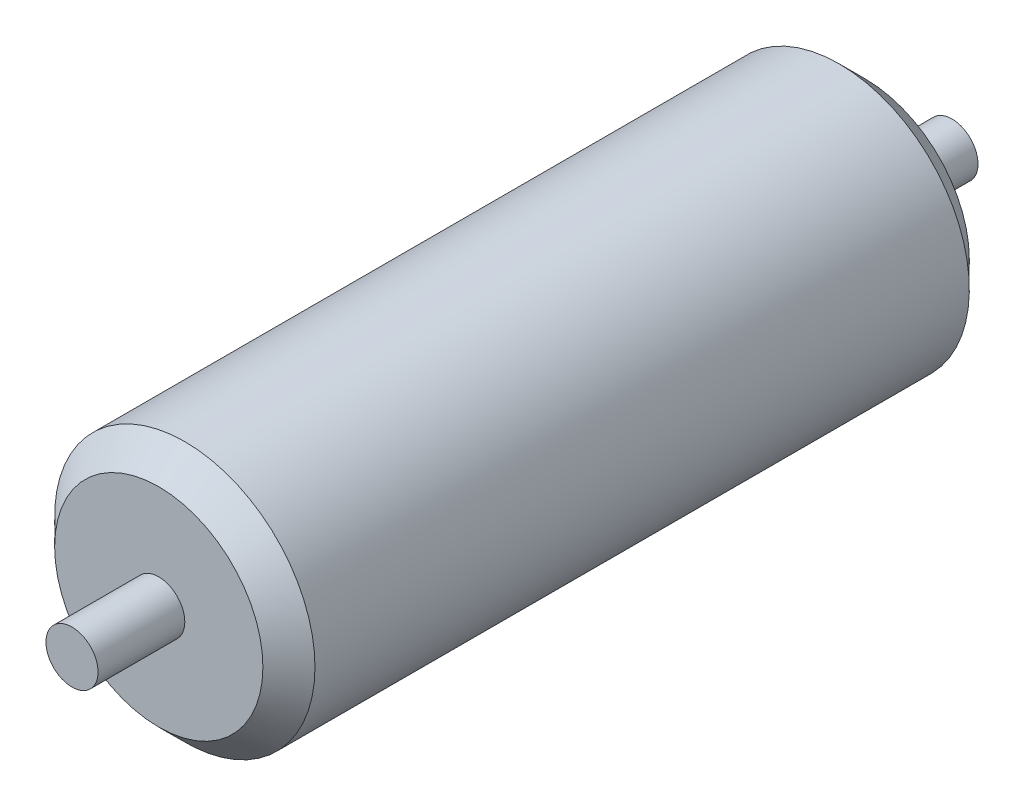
ISO-10303-21;
HEADER;
FILE_DESCRIPTION(('STEP AP214'),'2;1');
FILE_NAME('part.step','',(''),(''),'','','');
FILE_SCHEMA(('AUTOMOTIVE_DESIGN { 1 0 10303 214 1 1 1 1 }'));
ENDSEC;
DATA;
#1=APPLICATION_CONTEXT('core data for automotive mechanical design processes');
#2=APPLICATION_PROTOCOL_DEFINITION('international standard','automotive_design',2000,#1);
#3=PRODUCT_CONTEXT('',#1,'mechanical');
#4=PRODUCT('Part','Part','',(#3));
#5=PRODUCT_RELATED_PRODUCT_CATEGORY('part','',(#4));
#6=PRODUCT_DEFINITION_FORMATION('','',#4);
#7=PRODUCT_DEFINITION_CONTEXT('part definition',#1,'design');
#8=PRODUCT_DEFINITION('design','',#6,#7);
#9=PRODUCT_DEFINITION_SHAPE('','',#8);
#10=(LENGTH_UNIT() NAMED_UNIT(*) SI_UNIT(.MILLI.,.METRE.));
#11=(NAMED_UNIT(*) PLANE_ANGLE_UNIT() SI_UNIT($,.RADIAN.));
#12=(NAMED_UNIT(*) SI_UNIT($,.STERADIAN.) SOLID_ANGLE_UNIT());
#13=UNCERTAINTY_MEASURE_WITH_UNIT(LENGTH_MEASURE(1.E-05),#10,'distance_accuracy_value','');
#14=(GEOMETRIC_REPRESENTATION_CONTEXT(3) GLOBAL_UNCERTAINTY_ASSIGNED_CONTEXT((#13)) GLOBAL_UNIT_ASSIGNED_CONTEXT((#10,
#11,#12)) REPRESENTATION_CONTEXT('',''));
#15=CARTESIAN_POINT('',(0.,0.,0.));
#16=DIRECTION('',(0.,0.,1.));
#17=DIRECTION('',(1.,0.,0.));
#18=AXIS2_PLACEMENT_3D('',#15,#16,#17);
#19=CARTESIAN_POINT('',(0.,0.,407.));
#20=DIRECTION('',(0.,0.,1.));
#21=DIRECTION('',(0.,-1.,0.));
#22=AXIS2_PLACEMENT_3D('',#19,#20,#21);
#23=PLANE('',#22);
#24=CARTESIAN_POINT('',(0.,0.,407.));
#25=DIRECTION('',(0.,0.,-1.));
#26=DIRECTION('',(0.,1.,0.));
#27=AXIS2_PLACEMENT_3D('',#24,#25,#26);
#28=CIRCLE('',#27,120.);
#29=CARTESIAN_POINT('',(0.,120.,407.));
#30=VERTEX_POINT('',#29);
#31=EDGE_CURVE('E48',#30,#30,#28,.T.);
#32=ORIENTED_EDGE('',*,*,#31,.F.);
#33=EDGE_LOOP('',(#32));
#34=FACE_BOUND('',#33,.T.);
#35=CARTESIAN_POINT('',(0.,0.,407.));
#36=DIRECTION('',(0.,0.,1.));
#37=DIRECTION('',(1.,0.,0.));
#38=AXIS2_PLACEMENT_3D('',#35,#36,#37);
#39=CIRCLE('',#38,30.);
#40=CARTESIAN_POINT('',(30.,0.,407.));
#41=VERTEX_POINT('',#40);
#42=EDGE_CURVE('E63',#41,#41,#39,.T.);
#43=ORIENTED_EDGE('',*,*,#42,.F.);
#44=EDGE_LOOP('',(#43));
#45=FACE_BOUND('',#44,.T.);
#46=ADVANCED_FACE('F37',(#34,#45),#23,.T.);
#47=CARTESIAN_POINT('',(0.,0.,377.));
#48=DIRECTION('',(0.,0.,-1.));
#49=DIRECTION('',(-1.,0.,0.));
#50=AXIS2_PLACEMENT_3D('',#47,#48,#49);
#51=CYLINDRICAL_SURFACE('',#50,150.);
#52=CARTESIAN_POINT('',(0.,0.,377.));
#53=DIRECTION('',(0.,0.,1.));
#54=DIRECTION('',(1.,0.,0.));
#55=AXIS2_PLACEMENT_3D('',#52,#53,#54);
#56=CIRCLE('',#55,150.);
#57=CARTESIAN_POINT('',(150.,0.,377.));
#58=VERTEX_POINT('',#57);
#59=EDGE_CURVE('E44',#58,#58,#56,.T.);
#60=ORIENTED_EDGE('',*,*,#59,.F.);
#61=EDGE_LOOP('',(#60));
#62=FACE_BOUND('',#61,.T.);
#63=CARTESIAN_POINT('',(0.,0.,-377.));
#64=DIRECTION('',(0.,0.,-1.));
#65=DIRECTION('',(0.,1.,0.));
#66=AXIS2_PLACEMENT_3D('',#63,#64,#65);
#67=CIRCLE('',#66,150.);
#68=CARTESIAN_POINT('',(0.,150.,-377.));
#69=VERTEX_POINT('',#68);
#70=EDGE_CURVE('E57',#69,#69,#67,.T.);
#71=ORIENTED_EDGE('',*,*,#70,.F.);
#72=EDGE_LOOP('',(#71));
#73=FACE_BOUND('',#72,.T.);
#74=ADVANCED_FACE('F39',(#62,#73),#51,.T.);
#75=CARTESIAN_POINT('',(0.,0.,377.));
#76=DIRECTION('',(0.,0.,-1.));
#77=DIRECTION('',(0.,1.,0.));
#78=AXIS2_PLACEMENT_3D('',#75,#76,#77);
#79=CONICAL_SURFACE('',#78,150.,0.785398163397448);
#80=ORIENTED_EDGE('',*,*,#31,.T.);
#81=EDGE_LOOP('',(#80));
#82=FACE_BOUND('',#81,.T.);
#83=ORIENTED_EDGE('',*,*,#59,.T.);
#84=EDGE_LOOP('',(#83));
#85=FACE_BOUND('',#84,.T.);
#86=ADVANCED_FACE('F87',(#82,#85),#79,.T.);
#87=CARTESIAN_POINT('',(0.,0.,-407.));
#88=DIRECTION('',(0.,0.,-1.));
#89=DIRECTION('',(0.,-1.,0.));
#90=AXIS2_PLACEMENT_3D('',#87,#88,#89);
#91=PLANE('',#90);
#92=CARTESIAN_POINT('',(0.,0.,-407.));
#93=DIRECTION('',(0.,0.,-1.));
#94=DIRECTION('',(0.,1.,0.));
#95=AXIS2_PLACEMENT_3D('',#92,#93,#94);
#96=CIRCLE('',#95,30.);
#97=CARTESIAN_POINT('',(0.,30.,-407.));
#98=VERTEX_POINT('',#97);
#99=EDGE_CURVE('E10',#98,#98,#96,.T.);
#100=ORIENTED_EDGE('',*,*,#99,.F.);
#101=EDGE_LOOP('',(#100));
#102=FACE_BOUND('',#101,.T.);
#103=CARTESIAN_POINT('',(0.,0.,-407.));
#104=DIRECTION('',(0.,0.,-1.));
#105=DIRECTION('',(0.,1.,0.));
#106=AXIS2_PLACEMENT_3D('',#103,#104,#105);
#107=CIRCLE('',#106,120.);
#108=CARTESIAN_POINT('',(0.,120.,-407.));
#109=VERTEX_POINT('',#108);
#110=EDGE_CURVE('E52',#109,#109,#107,.T.);
#111=ORIENTED_EDGE('',*,*,#110,.T.);
#112=EDGE_LOOP('',(#111));
#113=FACE_BOUND('',#112,.T.);
#114=ADVANCED_FACE('F94',(#102,#113),#91,.T.);
#115=CARTESIAN_POINT('',(0.,0.,-377.));
#116=DIRECTION('',(0.,0.,1.));
#117=DIRECTION('',(0.,1.,0.));
#118=AXIS2_PLACEMENT_3D('',#115,#116,#117);
#119=CONICAL_SURFACE('',#118,150.,0.785398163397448);
#120=ORIENTED_EDGE('',*,*,#110,.F.);
#121=EDGE_LOOP('',(#120));
#122=FACE_BOUND('',#121,.T.);
#123=ORIENTED_EDGE('',*,*,#70,.T.);
#124=EDGE_LOOP('',(#123));
#125=FACE_BOUND('',#124,.T.);
#126=ADVANCED_FACE('F98',(#122,#125),#119,.T.);
#127=CARTESIAN_POINT('',(0.,0.,507.));
#128=DIRECTION('',(0.,0.,-1.));
#129=DIRECTION('',(-1.,0.,0.));
#130=AXIS2_PLACEMENT_3D('',#127,#128,#129);
#131=CYLINDRICAL_SURFACE('',#130,30.);
#132=CARTESIAN_POINT('',(0.,0.,507.));
#133=DIRECTION('',(0.,0.,1.));
#134=DIRECTION('',(1.,0.,0.));
#135=AXIS2_PLACEMENT_3D('',#132,#133,#134);
#136=CIRCLE('',#135,30.);
#137=CARTESIAN_POINT('',(30.,0.,507.));
#138=VERTEX_POINT('',#137);
#139=EDGE_CURVE('E60',#138,#138,#136,.T.);
#140=ORIENTED_EDGE('',*,*,#139,.F.);
#141=EDGE_LOOP('',(#140));
#142=FACE_BOUND('',#141,.T.);
#143=ORIENTED_EDGE('',*,*,#42,.T.);
#144=EDGE_LOOP('',(#143));
#145=FACE_BOUND('',#144,.T.);
#146=ADVANCED_FACE('F101',(#142,#145),#131,.T.);
#147=CARTESIAN_POINT('',(0.,0.,507.));
#148=DIRECTION('',(0.,0.,1.));
#149=DIRECTION('',(1.,0.,0.));
#150=AXIS2_PLACEMENT_3D('',#147,#148,#149);
#151=PLANE('',#150);
#152=ORIENTED_EDGE('',*,*,#139,.T.);
#153=EDGE_LOOP('',(#152));
#154=FACE_BOUND('',#153,.T.);
#155=ADVANCED_FACE('F78',(#154),#151,.T.);
#156=CARTESIAN_POINT('',(0.,0.,-507.));
#157=DIRECTION('',(0.,0.,1.));
#158=DIRECTION('',(1.,0.,0.));
#159=AXIS2_PLACEMENT_3D('',#156,#157,#158);
#160=CYLINDRICAL_SURFACE('',#159,30.);
#161=CARTESIAN_POINT('',(0.,0.,-507.));
#162=DIRECTION('',(0.,0.,1.));
#163=DIRECTION('',(1.,0.,0.));
#164=AXIS2_PLACEMENT_3D('',#161,#162,#163);
#165=CIRCLE('',#164,30.);
#166=CARTESIAN_POINT('',(30.,0.,-507.));
#167=VERTEX_POINT('',#166);
#168=EDGE_CURVE('E66',#167,#167,#165,.T.);
#169=ORIENTED_EDGE('',*,*,#168,.T.);
#170=EDGE_LOOP('',(#169));
#171=FACE_BOUND('',#170,.T.);
#172=ORIENTED_EDGE('',*,*,#99,.T.);
#173=EDGE_LOOP('',(#172));
#174=FACE_BOUND('',#173,.T.);
#175=ADVANCED_FACE('F70',(#171,#174),#160,.T.);
#176=CARTESIAN_POINT('',(0.,0.,-507.));
#177=DIRECTION('',(0.,0.,-1.));
#178=DIRECTION('',(1.,0.,0.));
#179=AXIS2_PLACEMENT_3D('',#176,#177,#178);
#180=PLANE('',#179);
#181=ORIENTED_EDGE('',*,*,#168,.F.);
#182=EDGE_LOOP('',(#181));
#183=FACE_BOUND('',#182,.T.);
#184=ADVANCED_FACE('F72',(#183),#180,.T.);
#185=CLOSED_SHELL('',(#46,#74,#86,#114,#126,#146,#155,#175,#184));
#186=MANIFOLD_SOLID_BREP('B2',#185);
#187=ADVANCED_BREP_SHAPE_REPRESENTATION('',(#18,#186),#14);
#188=SHAPE_DEFINITION_REPRESENTATION(#9,#187);
ENDSEC;
END-ISO-10303-21;
